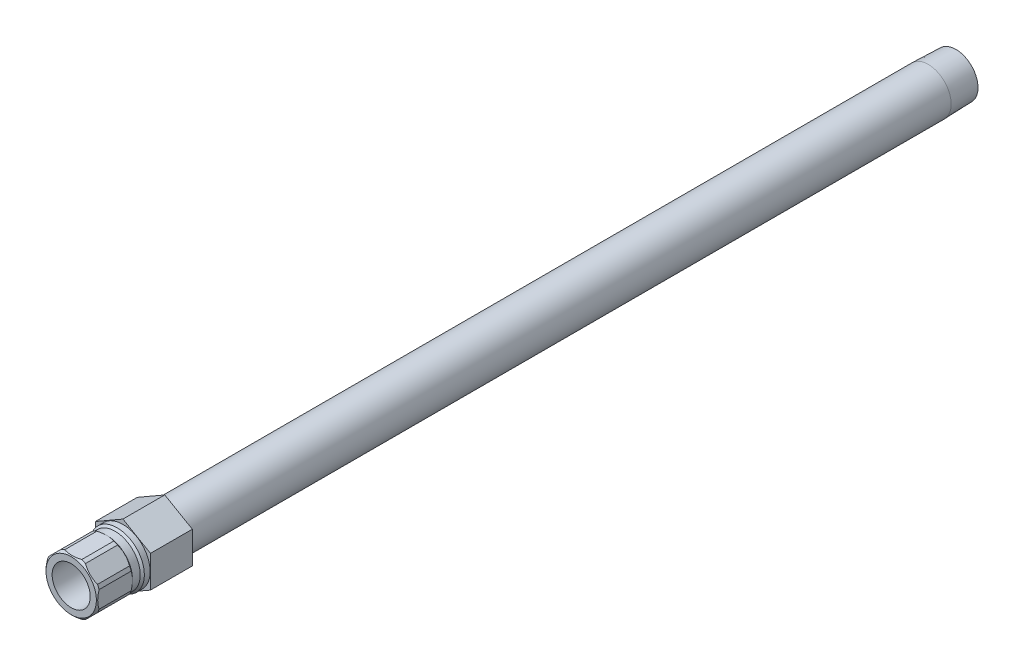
from build123d import *

# Parameters (mm, degrees)
SKETCH2_R           = 6.2611
BOSS_EXTRUDE1_DEPTH = 15.621
CUT_EXTRUDE1_START  = 5.8166
SKETCH3_OUTSIDE_W   = 88.912
SKETCH3_OUTSIDE_H   = 92.094
CUT_EXTRUDE1_DEPTH  = 306.476255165


with BuildPart() as part:
    # Sketch1 → Revolve1 (revolve)
    with BuildSketch(Plane(origin=(0, 0, 0), x_dir=(0, 0, -1), z_dir=(1, 0, 0))):
        Polygon((-19.304, 7.112), (-19.304, 9.398), (-18.542, 10.16), (-6.5786, 10.16), (-5.8166, 9.398), (-2.921, 9.398), (-2.159, 10.16), (0, 10.16), (0, 8.5725), (300.5582, 8.5725), (310.896, 8.249445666), (310.896, 6.2611), (-0.6731, 6.2611), (-1.524, 7.112), align=None)
    revolve(axis=Axis((0, 0, 0), (0, 0, 1)))

    # Sketch2 → Boss-Extrude1 (add)
    with BuildSketch(Plane.XY):
        Polygon((-10.287, 5.939202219), (-10.287, -5.939202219), (0, -11.878404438), (10.287, -5.939202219), (10.287, 5.939202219), (0, 11.878404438), align=None)
        with Locations(Location((0, 0, 0), (0, 0, 90))):
            Circle(SKETCH2_R, mode=Mode.SUBTRACT)
    extrude(amount=-BOSS_EXTRUDE1_DEPTH)

    # Sketch3 outside → Cut-Extrude1 (cut, through all)
    with BuildSketch(Plane.XY.offset(CUT_EXTRUDE1_START)):
        Rectangle(SKETCH3_OUTSIDE_W, SKETCH3_OUTSIDE_H)
        Polygon((9.652, -3.997989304), (9.652, 3.997989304), (3.997989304, 9.652), (-3.997989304, 9.652), (-9.652, 3.997989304), (-9.652, -3.997989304), (-3.997989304, -9.652), (3.997989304, -9.652), align=None, mode=Mode.SUBTRACT)
    extrude(amount=CUT_EXTRUDE1_DEPTH, mode=Mode.SUBTRACT)


solid = part.part
